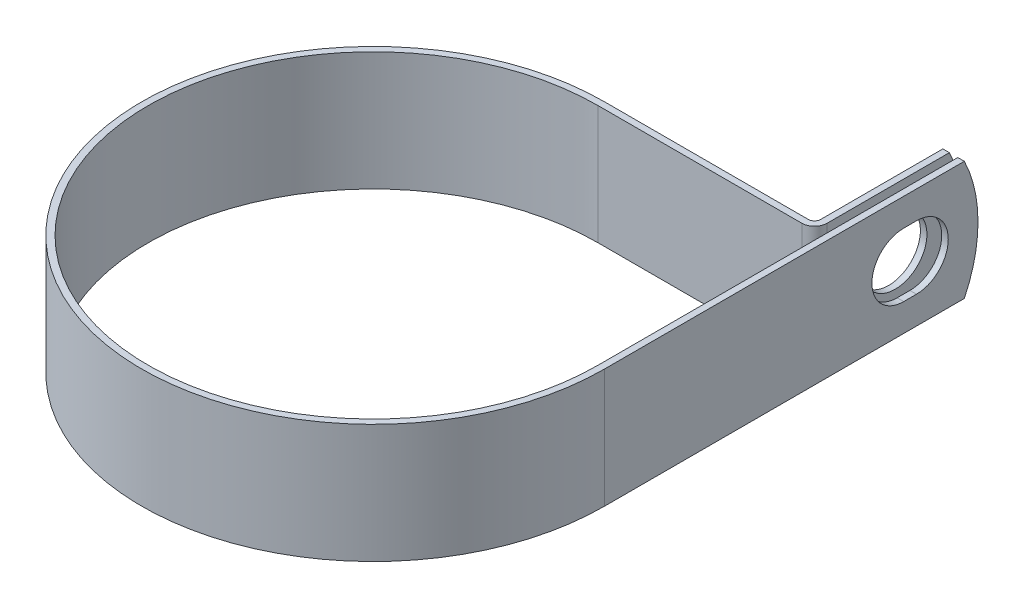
from build123d import *

# Parameters (mm, degrees)
EXTRUDE_THIN1_DEPTH = 11.1125
SKETCH2_R           = 5.9436
CUT_EXTRUDE1_DEPTH  = 1.2192
CUT_EXTRUDE2_REACH  = 113.784
CUT_EXTRUDE3_DEPTH  = 109.706083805


with BuildPart() as part:
    # Sketch1 → Extrude-Thin1 (new, symmetric)
    with BuildSketch(Plane(origin=(0, 0, 0), x_dir=(1, 0, 0), z_dir=(0, 1, 0))):
        with BuildLine():
            Line((42.0624, 69.85), (42.0624, 42.0624))
            Line((42.0624, 42.0624), (42.0624, 0))
            ThreePointArc((42.0624, 0), (-29.742608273, -29.742608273), (0, 42.0624))
            Line((0, 42.0624), (38.11016, 42.0624))
            ThreePointArc((38.11016, 42.0624), (39.791263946, 42.758736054), (40.4876, 44.43984))
            Line((40.4876, 44.43984), (40.4876, 69.85))
            Line((40.4876, 69.85), (39.2684, 69.85))
            Line((39.2684, 69.85), (39.2684, 44.43984))
            ThreePointArc((39.2684, 44.43984), (38.929159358, 43.620840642), (38.11016, 43.2816))
            Line((38.11016, 43.2816), (0, 43.2816))
            ThreePointArc((0, 43.2816), (-30.604712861, -30.604712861), (43.2816, 0))
            Line((43.2816, 0), (43.2816, 42.0624))
            Line((43.2816, 42.0624), (43.2816, 69.85))
            Line((43.2816, 69.85), (42.0624, 69.85))
        make_face()
    extrude(amount=EXTRUDE_THIN1_DEPTH, both=True)

    # Sketch2 → Cut-Extrude1 (cut)
    with BuildSketch(Plane.ZY.offset(-39.2684)):
        with Locations((-57.15, 0)):
            Circle(SKETCH2_R)
    extrude(amount=-CUT_EXTRUDE1_DEPTH, mode=Mode.SUBTRACT)

    # Sketch3 → Cut-Extrude2 (cut, up to next)
    with BuildSketch(Plane(origin=(43.2816, 0, 0), x_dir=(0, 0, -1), z_dir=(1, 0, 0)), mode=Mode.PRIVATE) as cut_extrude2_sk1:
        with BuildLine():
            Line((55.9562, 5.9436), (58.3438, 5.9436))
            ThreePointArc((58.3438, 5.9436), (64.2874, 0), (58.3438, -5.9436))
            Line((58.3438, -5.9436), (55.9562, -5.9436))
            ThreePointArc((55.9562, -5.9436), (50.0126, 0), (55.9562, 5.9436))
        make_face()
    cut_extrude2_tool1 = extrude(cut_extrude2_sk1.sketch, amount=-CUT_EXTRUDE2_REACH, mode=Mode.PRIVATE) & part.part
    add(cut_extrude2_tool1.solids().sort_by_distance((43.2816, 0, -57.15))[0], mode=Mode.SUBTRACT)

    # Sketch4 → Cut-Extrude3 (cut, through all)
    with BuildSketch(Plane.ZY.offset(-39.2684)):
        with BuildLine():
            Line((-67.29014763, 11.1125), (-69.85, 11.1125))
            Line((-69.85, 11.1125), (-69.85, -1.11e-07))
            ThreePointArc((-69.85, -1.11e-07), (-69.201765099, 5.701765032), (-67.29014763, 11.1125))
        make_face()
        with BuildLine():
            ThreePointArc((-67.29014763, -11.1125), (-69.201765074, -5.701765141), (-69.85, -1.11e-07))
            Line((-69.85, -1.11e-07), (-69.85, -11.1125))
            Line((-69.85, -11.1125), (-67.29014763, -11.1125))
        make_face()
    extrude(amount=-CUT_EXTRUDE3_DEPTH, mode=Mode.SUBTRACT)


solid = part.part
